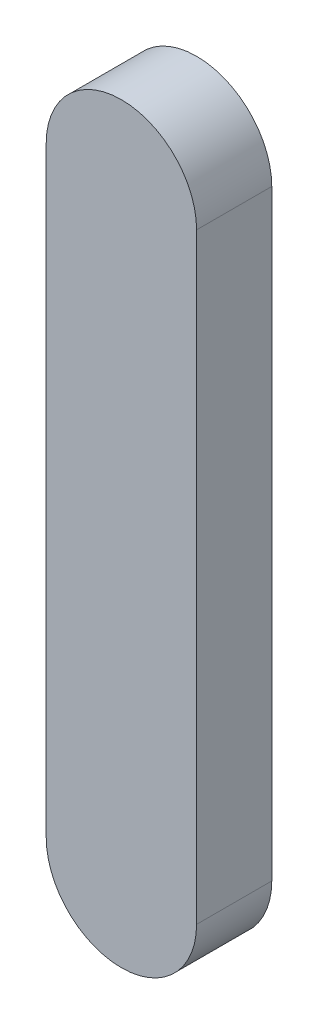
ISO-10303-21;
HEADER;
FILE_DESCRIPTION(('STEP AP214'),'2;1');
FILE_NAME('part.step','',(''),(''),'','','');
FILE_SCHEMA(('AUTOMOTIVE_DESIGN { 1 0 10303 214 1 1 1 1 }'));
ENDSEC;
DATA;
#1=APPLICATION_CONTEXT('core data for automotive mechanical design processes');
#2=APPLICATION_PROTOCOL_DEFINITION('international standard','automotive_design',2000,#1);
#3=PRODUCT_CONTEXT('',#1,'mechanical');
#4=PRODUCT('Part','Part','',(#3));
#5=PRODUCT_RELATED_PRODUCT_CATEGORY('part','',(#4));
#6=PRODUCT_DEFINITION_FORMATION('','',#4);
#7=PRODUCT_DEFINITION_CONTEXT('part definition',#1,'design');
#8=PRODUCT_DEFINITION('design','',#6,#7);
#9=PRODUCT_DEFINITION_SHAPE('','',#8);
#10=(LENGTH_UNIT() NAMED_UNIT(*) SI_UNIT(.MILLI.,.METRE.));
#11=(NAMED_UNIT(*) PLANE_ANGLE_UNIT() SI_UNIT($,.RADIAN.));
#12=(NAMED_UNIT(*) SI_UNIT($,.STERADIAN.) SOLID_ANGLE_UNIT());
#13=UNCERTAINTY_MEASURE_WITH_UNIT(LENGTH_MEASURE(1.E-05),#10,'distance_accuracy_value','');
#14=(GEOMETRIC_REPRESENTATION_CONTEXT(3) GLOBAL_UNCERTAINTY_ASSIGNED_CONTEXT((#13)) GLOBAL_UNIT_ASSIGNED_CONTEXT((#10,
#11,#12)) REPRESENTATION_CONTEXT('',''));
#15=CARTESIAN_POINT('',(0.,0.,0.));
#16=DIRECTION('',(0.,0.,1.));
#17=DIRECTION('',(1.,0.,0.));
#18=AXIS2_PLACEMENT_3D('',#15,#16,#17);
#19=CARTESIAN_POINT('',(0.,-16.,1.5));
#20=DIRECTION('',(0.,0.,-1.));
#21=DIRECTION('',(-1.,0.,0.));
#22=AXIS2_PLACEMENT_3D('',#19,#20,#21);
#23=CYLINDRICAL_SURFACE('',#22,1.5);
#24=CARTESIAN_POINT('',(0.,-16.,0.));
#25=DIRECTION('',(0.,0.,1.));
#26=DIRECTION('',(1.,0.,0.));
#27=AXIS2_PLACEMENT_3D('',#24,#25,#26);
#28=CIRCLE('',#27,1.5);
#29=CARTESIAN_POINT('',(-1.5,-16.,0.));
#30=VERTEX_POINT('',#29);
#31=CARTESIAN_POINT('',(1.5,-16.,0.));
#32=VERTEX_POINT('',#31);
#33=EDGE_CURVE('E96',#30,#32,#28,.T.);
#34=ORIENTED_EDGE('',*,*,#33,.T.);
#35=DIRECTION('',(0.,0.,-1.));
#36=VECTOR('',#35,1.);
#37=CARTESIAN_POINT('',(1.5,-16.,1.5));
#38=LINE('',#37,#36);
#39=CARTESIAN_POINT('',(1.5,-16.,1.5));
#40=VERTEX_POINT('',#39);
#41=EDGE_CURVE('E11',#40,#32,#38,.T.);
#42=ORIENTED_EDGE('',*,*,#41,.F.);
#43=CARTESIAN_POINT('',(0.,-16.,1.5));
#44=DIRECTION('',(0.,0.,1.));
#45=DIRECTION('',(1.,0.,0.));
#46=AXIS2_PLACEMENT_3D('',#43,#44,#45);
#47=CIRCLE('',#46,1.5);
#48=CARTESIAN_POINT('',(-1.5,-16.,1.5));
#49=VERTEX_POINT('',#48);
#50=EDGE_CURVE('E84',#49,#40,#47,.T.);
#51=ORIENTED_EDGE('',*,*,#50,.F.);
#52=DIRECTION('',(0.,0.,-1.));
#53=VECTOR('',#52,1.);
#54=CARTESIAN_POINT('',(-1.5,-16.,1.5));
#55=LINE('',#54,#53);
#56=EDGE_CURVE('E92',#49,#30,#55,.T.);
#57=ORIENTED_EDGE('',*,*,#56,.T.);
#58=EDGE_LOOP('',(#34,#42,#51,#57));
#59=FACE_BOUND('',#58,.T.);
#60=ADVANCED_FACE('F33',(#59),#23,.T.);
#61=CARTESIAN_POINT('',(1.5,-16.,1.5));
#62=DIRECTION('',(-1.,0.,0.));
#63=DIRECTION('',(0.,0.,1.));
#64=AXIS2_PLACEMENT_3D('',#61,#62,#63);
#65=PLANE('',#64);
#66=DIRECTION('',(0.,1.,0.));
#67=VECTOR('',#66,1.);
#68=CARTESIAN_POINT('',(1.5,-16.,0.));
#69=LINE('',#68,#67);
#70=CARTESIAN_POINT('',(1.5,-4.,0.));
#71=VERTEX_POINT('',#70);
#72=EDGE_CURVE('E88',#32,#71,#69,.T.);
#73=ORIENTED_EDGE('',*,*,#72,.T.);
#74=DIRECTION('',(0.,0.,-1.));
#75=VECTOR('',#74,1.);
#76=CARTESIAN_POINT('',(1.5,-4.,1.5));
#77=LINE('',#76,#75);
#78=CARTESIAN_POINT('',(1.5,-4.,1.5));
#79=VERTEX_POINT('',#78);
#80=EDGE_CURVE('E41',#79,#71,#77,.T.);
#81=ORIENTED_EDGE('',*,*,#80,.F.);
#82=DIRECTION('',(0.,1.,0.));
#83=VECTOR('',#82,1.);
#84=CARTESIAN_POINT('',(1.5,-16.,1.5));
#85=LINE('',#84,#83);
#86=EDGE_CURVE('E79',#40,#79,#85,.T.);
#87=ORIENTED_EDGE('',*,*,#86,.F.);
#88=ORIENTED_EDGE('',*,*,#41,.T.);
#89=EDGE_LOOP('',(#73,#81,#87,#88));
#90=FACE_BOUND('',#89,.T.);
#91=ADVANCED_FACE('F87',(#90),#65,.F.);
#92=CARTESIAN_POINT('',(0.,-4.,1.5));
#93=DIRECTION('',(0.,0.,-1.));
#94=DIRECTION('',(-1.,0.,0.));
#95=AXIS2_PLACEMENT_3D('',#92,#93,#94);
#96=CYLINDRICAL_SURFACE('',#95,1.5);
#97=CARTESIAN_POINT('',(0.,-4.,0.));
#98=DIRECTION('',(0.,0.,1.));
#99=DIRECTION('',(1.,0.,0.));
#100=AXIS2_PLACEMENT_3D('',#97,#98,#99);
#101=CIRCLE('',#100,1.5);
#102=CARTESIAN_POINT('',(-1.5,-4.,0.));
#103=VERTEX_POINT('',#102);
#104=EDGE_CURVE('E66',#71,#103,#101,.T.);
#105=ORIENTED_EDGE('',*,*,#104,.T.);
#106=DIRECTION('',(0.,0.,-1.));
#107=VECTOR('',#106,1.);
#108=CARTESIAN_POINT('',(-1.5,-4.,1.5));
#109=LINE('',#108,#107);
#110=CARTESIAN_POINT('',(-1.5,-4.,1.5));
#111=VERTEX_POINT('',#110);
#112=EDGE_CURVE('E89',#111,#103,#109,.T.);
#113=ORIENTED_EDGE('',*,*,#112,.F.);
#114=CARTESIAN_POINT('',(0.,-4.,1.5));
#115=DIRECTION('',(0.,0.,1.));
#116=DIRECTION('',(1.,0.,0.));
#117=AXIS2_PLACEMENT_3D('',#114,#115,#116);
#118=CIRCLE('',#117,1.5);
#119=EDGE_CURVE('E82',#79,#111,#118,.T.);
#120=ORIENTED_EDGE('',*,*,#119,.F.);
#121=ORIENTED_EDGE('',*,*,#80,.T.);
#122=EDGE_LOOP('',(#105,#113,#120,#121));
#123=FACE_BOUND('',#122,.T.);
#124=ADVANCED_FACE('F90',(#123),#96,.T.);
#125=CARTESIAN_POINT('',(-1.5,-4.,1.5));
#126=DIRECTION('',(1.,0.,0.));
#127=DIRECTION('',(0.,1.,0.));
#128=AXIS2_PLACEMENT_3D('',#125,#126,#127);
#129=PLANE('',#128);
#130=DIRECTION('',(0.,-1.,0.));
#131=VECTOR('',#130,1.);
#132=CARTESIAN_POINT('',(-1.5,-4.,0.));
#133=LINE('',#132,#131);
#134=EDGE_CURVE('E72',#103,#30,#133,.T.);
#135=ORIENTED_EDGE('',*,*,#134,.T.);
#136=ORIENTED_EDGE('',*,*,#56,.F.);
#137=DIRECTION('',(0.,-1.,0.));
#138=VECTOR('',#137,1.);
#139=CARTESIAN_POINT('',(-1.5,-4.,1.5));
#140=LINE('',#139,#138);
#141=EDGE_CURVE('E49',#111,#49,#140,.T.);
#142=ORIENTED_EDGE('',*,*,#141,.F.);
#143=ORIENTED_EDGE('',*,*,#112,.T.);
#144=EDGE_LOOP('',(#135,#136,#142,#143));
#145=FACE_BOUND('',#144,.T.);
#146=ADVANCED_FACE('F103',(#145),#129,.F.);
#147=CARTESIAN_POINT('',(0.,-16.,1.5));
#148=DIRECTION('',(0.,0.,1.));
#149=DIRECTION('',(1.,0.,0.));
#150=AXIS2_PLACEMENT_3D('',#147,#148,#149);
#151=PLANE('',#150);
#152=ORIENTED_EDGE('',*,*,#50,.T.);
#153=ORIENTED_EDGE('',*,*,#86,.T.);
#154=ORIENTED_EDGE('',*,*,#119,.T.);
#155=ORIENTED_EDGE('',*,*,#141,.T.);
#156=EDGE_LOOP('',(#152,#153,#154,#155));
#157=FACE_BOUND('',#156,.T.);
#158=ADVANCED_FACE('F80',(#157),#151,.T.);
#159=CARTESIAN_POINT('',(0.,-16.,0.));
#160=DIRECTION('',(0.,0.,1.));
#161=DIRECTION('',(1.,0.,0.));
#162=AXIS2_PLACEMENT_3D('',#159,#160,#161);
#163=PLANE('',#162);
#164=ORIENTED_EDGE('',*,*,#33,.F.);
#165=ORIENTED_EDGE('',*,*,#134,.F.);
#166=ORIENTED_EDGE('',*,*,#104,.F.);
#167=ORIENTED_EDGE('',*,*,#72,.F.);
#168=EDGE_LOOP('',(#164,#165,#166,#167));
#169=FACE_BOUND('',#168,.T.);
#170=ADVANCED_FACE('F106',(#169),#163,.F.);
#171=CLOSED_SHELL('',(#60,#91,#124,#146,#158,#170));
#172=MANIFOLD_SOLID_BREP('B2',#171);
#173=ADVANCED_BREP_SHAPE_REPRESENTATION('',(#18,#172),#14);
#174=SHAPE_DEFINITION_REPRESENTATION(#9,#173);
ENDSEC;
END-ISO-10303-21;
